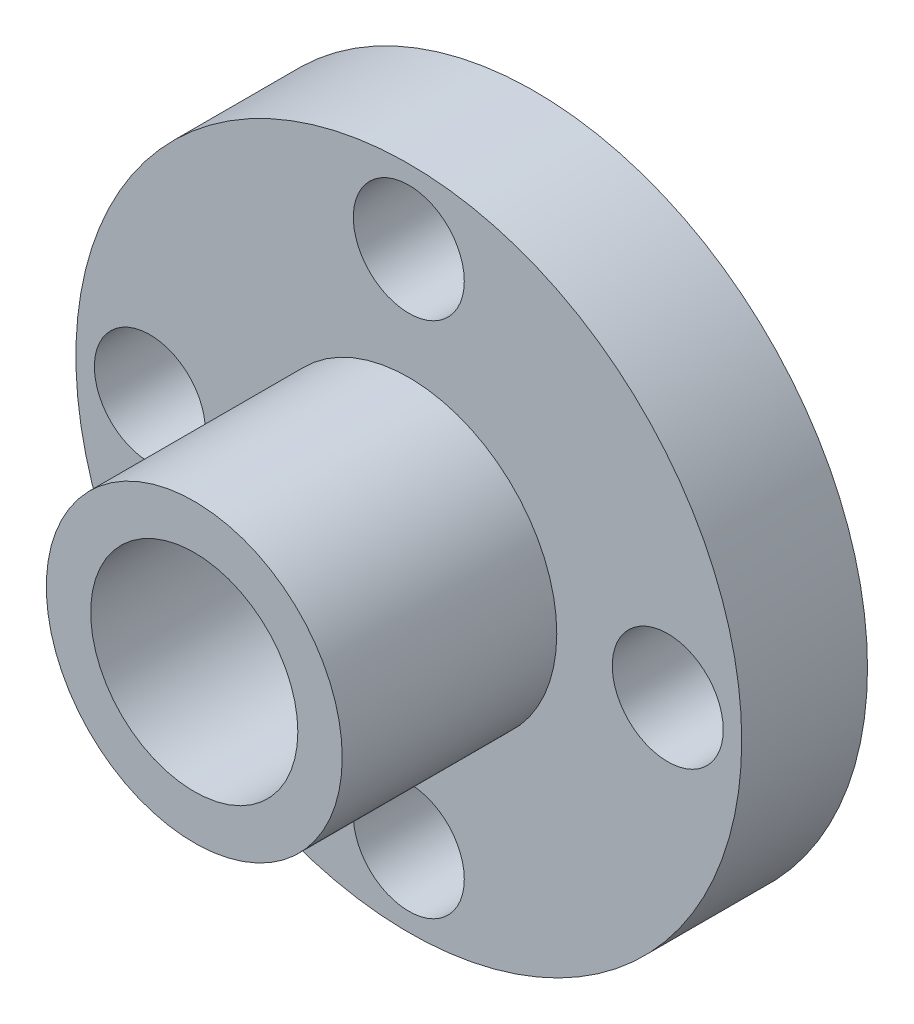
ISO-10303-21;
HEADER;
FILE_DESCRIPTION(('STEP AP214'),'2;1');
FILE_NAME('part.step','',(''),(''),'','','');
FILE_SCHEMA(('AUTOMOTIVE_DESIGN { 1 0 10303 214 1 1 1 1 }'));
ENDSEC;
DATA;
#1=APPLICATION_CONTEXT('core data for automotive mechanical design processes');
#2=APPLICATION_PROTOCOL_DEFINITION('international standard','automotive_design',2000,#1);
#3=PRODUCT_CONTEXT('',#1,'mechanical');
#4=PRODUCT('Part','Part','',(#3));
#5=PRODUCT_RELATED_PRODUCT_CATEGORY('part','',(#4));
#6=PRODUCT_DEFINITION_FORMATION('','',#4);
#7=PRODUCT_DEFINITION_CONTEXT('part definition',#1,'design');
#8=PRODUCT_DEFINITION('design','',#6,#7);
#9=PRODUCT_DEFINITION_SHAPE('','',#8);
#10=(LENGTH_UNIT() NAMED_UNIT(*) SI_UNIT(.MILLI.,.METRE.));
#11=(NAMED_UNIT(*) PLANE_ANGLE_UNIT() SI_UNIT($,.RADIAN.));
#12=(NAMED_UNIT(*) SI_UNIT($,.STERADIAN.) SOLID_ANGLE_UNIT());
#13=UNCERTAINTY_MEASURE_WITH_UNIT(LENGTH_MEASURE(1.E-05),#10,'distance_accuracy_value','');
#14=(GEOMETRIC_REPRESENTATION_CONTEXT(3) GLOBAL_UNCERTAINTY_ASSIGNED_CONTEXT((#13)) GLOBAL_UNIT_ASSIGNED_CONTEXT((#10,
#11,#12)) REPRESENTATION_CONTEXT('',''));
#15=CARTESIAN_POINT('',(0.,0.,0.));
#16=DIRECTION('',(0.,0.,1.));
#17=DIRECTION('',(1.,0.,0.));
#18=AXIS2_PLACEMENT_3D('',#15,#16,#17);
#19=CARTESIAN_POINT('',(0.,0.,-85.));
#20=DIRECTION('',(0.,0.,1.));
#21=DIRECTION('',(1.,0.,0.));
#22=AXIS2_PLACEMENT_3D('',#19,#20,#21);
#23=PLANE('',#22);
#24=CARTESIAN_POINT('',(0.,175.,-85.));
#25=DIRECTION('',(0.,0.,1.));
#26=DIRECTION('',(1.,0.,0.));
#27=AXIS2_PLACEMENT_3D('',#24,#25,#26);
#28=CIRCLE('',#27,37.5);
#29=CARTESIAN_POINT('',(37.5,175.,-85.));
#30=VERTEX_POINT('',#29);
#31=EDGE_CURVE('E73',#30,#30,#28,.T.);
#32=ORIENTED_EDGE('',*,*,#31,.T.);
#33=EDGE_LOOP('',(#32));
#34=FACE_BOUND('',#33,.T.);
#35=CARTESIAN_POINT('',(-175.,1.83302770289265E-12,-85.));
#36=DIRECTION('',(0.,0.,1.));
#37=DIRECTION('',(1.,0.,0.));
#38=AXIS2_PLACEMENT_3D('',#35,#36,#37);
#39=CIRCLE('',#38,37.5);
#40=CARTESIAN_POINT('',(-137.5,1.83302770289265E-12,-85.));
#41=VERTEX_POINT('',#40);
#42=EDGE_CURVE('E93',#41,#41,#39,.T.);
#43=ORIENTED_EDGE('',*,*,#42,.T.);
#44=EDGE_LOOP('',(#43));
#45=FACE_BOUND('',#44,.T.);
#46=CARTESIAN_POINT('',(175.,-6.11009234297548E-13,-85.));
#47=DIRECTION('',(0.,0.,1.));
#48=DIRECTION('',(1.,0.,0.));
#49=AXIS2_PLACEMENT_3D('',#46,#47,#48);
#50=CIRCLE('',#49,37.5);
#51=CARTESIAN_POINT('',(212.5,-6.11009234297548E-13,-85.));
#52=VERTEX_POINT('',#51);
#53=EDGE_CURVE('E85',#52,#52,#50,.T.);
#54=ORIENTED_EDGE('',*,*,#53,.T.);
#55=EDGE_LOOP('',(#54));
#56=FACE_BOUND('',#55,.T.);
#57=CARTESIAN_POINT('',(-1.2220184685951E-12,-175.,-85.));
#58=DIRECTION('',(0.,0.,1.));
#59=DIRECTION('',(1.,0.,0.));
#60=AXIS2_PLACEMENT_3D('',#57,#58,#59);
#61=CIRCLE('',#60,37.5);
#62=CARTESIAN_POINT('',(37.4999999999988,-175.,-85.));
#63=VERTEX_POINT('',#62);
#64=EDGE_CURVE('E77',#63,#63,#61,.T.);
#65=ORIENTED_EDGE('',*,*,#64,.T.);
#66=EDGE_LOOP('',(#65));
#67=FACE_BOUND('',#66,.T.);
#68=CARTESIAN_POINT('',(0.,0.,-85.));
#69=DIRECTION('',(0.,0.,1.));
#70=DIRECTION('',(1.,0.,0.));
#71=AXIS2_PLACEMENT_3D('',#68,#69,#70);
#72=CIRCLE('',#71,70.);
#73=CARTESIAN_POINT('',(70.,0.,-85.));
#74=VERTEX_POINT('',#73);
#75=EDGE_CURVE('E68',#74,#74,#72,.T.);
#76=ORIENTED_EDGE('',*,*,#75,.T.);
#77=EDGE_LOOP('',(#76));
#78=FACE_BOUND('',#77,.T.);
#79=CARTESIAN_POINT('',(0.,0.,-85.));
#80=DIRECTION('',(0.,0.,1.));
#81=DIRECTION('',(1.,0.,0.));
#82=AXIS2_PLACEMENT_3D('',#79,#80,#81);
#83=CIRCLE('',#82,225.);
#84=CARTESIAN_POINT('',(225.,0.,-85.));
#85=VERTEX_POINT('',#84);
#86=EDGE_CURVE('E10',#85,#85,#83,.T.);
#87=ORIENTED_EDGE('',*,*,#86,.F.);
#88=EDGE_LOOP('',(#87));
#89=FACE_BOUND('',#88,.T.);
#90=ADVANCED_FACE('F45',(#34,#45,#56,#67,#78,#89),#23,.F.);
#91=CARTESIAN_POINT('',(0.,0.,277.29666413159));
#92=DIRECTION('',(0.,0.,1.));
#93=DIRECTION('',(1.,0.,0.));
#94=AXIS2_PLACEMENT_3D('',#91,#92,#93);
#95=CYLINDRICAL_SURFACE('',#94,225.);
#96=ORIENTED_EDGE('',*,*,#86,.T.);
#97=EDGE_LOOP('',(#96));
#98=FACE_BOUND('',#97,.T.);
#99=CARTESIAN_POINT('',(0.,0.,0.));
#100=DIRECTION('',(0.,0.,1.));
#101=DIRECTION('',(1.,0.,0.));
#102=AXIS2_PLACEMENT_3D('',#99,#100,#101);
#103=CIRCLE('',#102,225.);
#104=CARTESIAN_POINT('',(225.,0.,0.));
#105=VERTEX_POINT('',#104);
#106=EDGE_CURVE('E52',#105,#105,#103,.T.);
#107=ORIENTED_EDGE('',*,*,#106,.F.);
#108=EDGE_LOOP('',(#107));
#109=FACE_BOUND('',#108,.T.);
#110=ADVANCED_FACE('F122',(#98,#109),#95,.T.);
#111=CARTESIAN_POINT('',(0.,0.,0.));
#112=DIRECTION('',(0.,0.,1.));
#113=DIRECTION('',(1.,0.,0.));
#114=AXIS2_PLACEMENT_3D('',#111,#112,#113);
#115=PLANE('',#114);
#116=CARTESIAN_POINT('',(0.,175.,0.));
#117=DIRECTION('',(0.,0.,1.));
#118=DIRECTION('',(1.,0.,0.));
#119=AXIS2_PLACEMENT_3D('',#116,#117,#118);
#120=CIRCLE('',#119,37.5);
#121=CARTESIAN_POINT('',(37.5,175.,0.));
#122=VERTEX_POINT('',#121);
#123=EDGE_CURVE('E101',#122,#122,#120,.T.);
#124=ORIENTED_EDGE('',*,*,#123,.F.);
#125=EDGE_LOOP('',(#124));
#126=FACE_BOUND('',#125,.T.);
#127=CARTESIAN_POINT('',(-175.,1.83302770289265E-12,0.));
#128=DIRECTION('',(0.,0.,1.));
#129=DIRECTION('',(1.,0.,0.));
#130=AXIS2_PLACEMENT_3D('',#127,#128,#129);
#131=CIRCLE('',#130,37.5);
#132=CARTESIAN_POINT('',(-137.5,1.83302770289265E-12,0.));
#133=VERTEX_POINT('',#132);
#134=EDGE_CURVE('E97',#133,#133,#131,.T.);
#135=ORIENTED_EDGE('',*,*,#134,.F.);
#136=EDGE_LOOP('',(#135));
#137=FACE_BOUND('',#136,.T.);
#138=CARTESIAN_POINT('',(175.,-6.11009234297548E-13,0.));
#139=DIRECTION('',(0.,0.,1.));
#140=DIRECTION('',(1.,0.,0.));
#141=AXIS2_PLACEMENT_3D('',#138,#139,#140);
#142=CIRCLE('',#141,37.5);
#143=CARTESIAN_POINT('',(212.5,-6.11009234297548E-13,0.));
#144=VERTEX_POINT('',#143);
#145=EDGE_CURVE('E89',#144,#144,#142,.T.);
#146=ORIENTED_EDGE('',*,*,#145,.F.);
#147=EDGE_LOOP('',(#146));
#148=FACE_BOUND('',#147,.T.);
#149=CARTESIAN_POINT('',(-1.2220184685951E-12,-175.,0.));
#150=DIRECTION('',(0.,0.,1.));
#151=DIRECTION('',(1.,0.,0.));
#152=AXIS2_PLACEMENT_3D('',#149,#150,#151);
#153=CIRCLE('',#152,37.5);
#154=CARTESIAN_POINT('',(37.4999999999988,-175.,0.));
#155=VERTEX_POINT('',#154);
#156=EDGE_CURVE('E81',#155,#155,#153,.T.);
#157=ORIENTED_EDGE('',*,*,#156,.F.);
#158=EDGE_LOOP('',(#157));
#159=FACE_BOUND('',#158,.T.);
#160=ORIENTED_EDGE('',*,*,#106,.T.);
#161=EDGE_LOOP('',(#160));
#162=FACE_BOUND('',#161,.T.);
#163=CARTESIAN_POINT('',(0.,0.,0.));
#164=DIRECTION('',(0.,0.,1.));
#165=DIRECTION('',(1.,0.,0.));
#166=AXIS2_PLACEMENT_3D('',#163,#164,#165);
#167=CIRCLE('',#166,100.);
#168=CARTESIAN_POINT('',(100.,0.,0.));
#169=VERTEX_POINT('',#168);
#170=EDGE_CURVE('E57',#169,#169,#167,.T.);
#171=ORIENTED_EDGE('',*,*,#170,.F.);
#172=EDGE_LOOP('',(#171));
#173=FACE_BOUND('',#172,.T.);
#174=ADVANCED_FACE('F118',(#126,#137,#148,#159,#162,#173),#115,.T.);
#175=CARTESIAN_POINT('',(0.,0.,277.29666413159));
#176=DIRECTION('',(0.,0.,1.));
#177=DIRECTION('',(1.,0.,0.));
#178=AXIS2_PLACEMENT_3D('',#175,#176,#177);
#179=CYLINDRICAL_SURFACE('',#178,100.);
#180=CARTESIAN_POINT('',(0.,0.,145.));
#181=DIRECTION('',(0.,0.,1.));
#182=DIRECTION('',(1.,0.,0.));
#183=AXIS2_PLACEMENT_3D('',#180,#181,#182);
#184=CIRCLE('',#183,100.);
#185=CARTESIAN_POINT('',(100.,0.,145.));
#186=VERTEX_POINT('',#185);
#187=EDGE_CURVE('E62',#186,#186,#184,.T.);
#188=ORIENTED_EDGE('',*,*,#187,.F.);
#189=EDGE_LOOP('',(#188));
#190=FACE_BOUND('',#189,.T.);
#191=ORIENTED_EDGE('',*,*,#170,.T.);
#192=EDGE_LOOP('',(#191));
#193=FACE_BOUND('',#192,.T.);
#194=ADVANCED_FACE('F121',(#190,#193),#179,.T.);
#195=CARTESIAN_POINT('',(0.,0.,145.));
#196=DIRECTION('',(0.,0.,1.));
#197=DIRECTION('',(1.,0.,0.));
#198=AXIS2_PLACEMENT_3D('',#195,#196,#197);
#199=PLANE('',#198);
#200=CARTESIAN_POINT('',(0.,0.,145.));
#201=DIRECTION('',(0.,0.,1.));
#202=DIRECTION('',(1.,0.,0.));
#203=AXIS2_PLACEMENT_3D('',#200,#201,#202);
#204=CIRCLE('',#203,70.);
#205=CARTESIAN_POINT('',(70.,0.,145.));
#206=VERTEX_POINT('',#205);
#207=EDGE_CURVE('E69',#206,#206,#204,.T.);
#208=ORIENTED_EDGE('',*,*,#207,.F.);
#209=EDGE_LOOP('',(#208));
#210=FACE_BOUND('',#209,.T.);
#211=ORIENTED_EDGE('',*,*,#187,.T.);
#212=EDGE_LOOP('',(#211));
#213=FACE_BOUND('',#212,.T.);
#214=ADVANCED_FACE('F133',(#210,#213),#199,.T.);
#215=CARTESIAN_POINT('',(0.,0.,-85.));
#216=DIRECTION('',(0.,0.,1.));
#217=DIRECTION('',(1.,0.,0.));
#218=AXIS2_PLACEMENT_3D('',#215,#216,#217);
#219=CYLINDRICAL_SURFACE('',#218,70.);
#220=ORIENTED_EDGE('',*,*,#75,.F.);
#221=EDGE_LOOP('',(#220));
#222=FACE_BOUND('',#221,.T.);
#223=ORIENTED_EDGE('',*,*,#207,.T.);
#224=EDGE_LOOP('',(#223));
#225=FACE_BOUND('',#224,.T.);
#226=ADVANCED_FACE('F140',(#222,#225),#219,.F.);
#227=CARTESIAN_POINT('',(-1.2220184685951E-12,-175.,-85.));
#228=DIRECTION('',(0.,0.,1.));
#229=DIRECTION('',(1.,0.,0.));
#230=AXIS2_PLACEMENT_3D('',#227,#228,#229);
#231=CYLINDRICAL_SURFACE('',#230,37.5);
#232=ORIENTED_EDGE('',*,*,#64,.F.);
#233=EDGE_LOOP('',(#232));
#234=FACE_BOUND('',#233,.T.);
#235=ORIENTED_EDGE('',*,*,#156,.T.);
#236=EDGE_LOOP('',(#235));
#237=FACE_BOUND('',#236,.T.);
#238=ADVANCED_FACE('F183',(#234,#237),#231,.F.);
#239=CARTESIAN_POINT('',(175.,-6.11009234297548E-13,-85.));
#240=DIRECTION('',(0.,0.,1.));
#241=DIRECTION('',(1.,0.,0.));
#242=AXIS2_PLACEMENT_3D('',#239,#240,#241);
#243=CYLINDRICAL_SURFACE('',#242,37.5);
#244=ORIENTED_EDGE('',*,*,#53,.F.);
#245=EDGE_LOOP('',(#244));
#246=FACE_BOUND('',#245,.T.);
#247=ORIENTED_EDGE('',*,*,#145,.T.);
#248=EDGE_LOOP('',(#247));
#249=FACE_BOUND('',#248,.T.);
#250=ADVANCED_FACE('F192',(#246,#249),#243,.F.);
#251=CARTESIAN_POINT('',(-175.,1.83302770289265E-12,-85.));
#252=DIRECTION('',(0.,0.,1.));
#253=DIRECTION('',(1.,0.,0.));
#254=AXIS2_PLACEMENT_3D('',#251,#252,#253);
#255=CYLINDRICAL_SURFACE('',#254,37.5);
#256=ORIENTED_EDGE('',*,*,#42,.F.);
#257=EDGE_LOOP('',(#256));
#258=FACE_BOUND('',#257,.T.);
#259=ORIENTED_EDGE('',*,*,#134,.T.);
#260=EDGE_LOOP('',(#259));
#261=FACE_BOUND('',#260,.T.);
#262=ADVANCED_FACE('F114',(#258,#261),#255,.F.);
#263=CARTESIAN_POINT('',(0.,175.,-85.));
#264=DIRECTION('',(0.,0.,1.));
#265=DIRECTION('',(1.,0.,0.));
#266=AXIS2_PLACEMENT_3D('',#263,#264,#265);
#267=CYLINDRICAL_SURFACE('',#266,37.5);
#268=ORIENTED_EDGE('',*,*,#31,.F.);
#269=EDGE_LOOP('',(#268));
#270=FACE_BOUND('',#269,.T.);
#271=ORIENTED_EDGE('',*,*,#123,.T.);
#272=EDGE_LOOP('',(#271));
#273=FACE_BOUND('',#272,.T.);
#274=ADVANCED_FACE('F111',(#270,#273),#267,.F.);
#275=CLOSED_SHELL('',(#90,#110,#174,#194,#214,#226,#238,#250,#262,#274));
#276=MANIFOLD_SOLID_BREP('B2',#275);
#277=ADVANCED_BREP_SHAPE_REPRESENTATION('',(#18,#276),#14);
#278=SHAPE_DEFINITION_REPRESENTATION(#9,#277);
ENDSEC;
END-ISO-10303-21;
